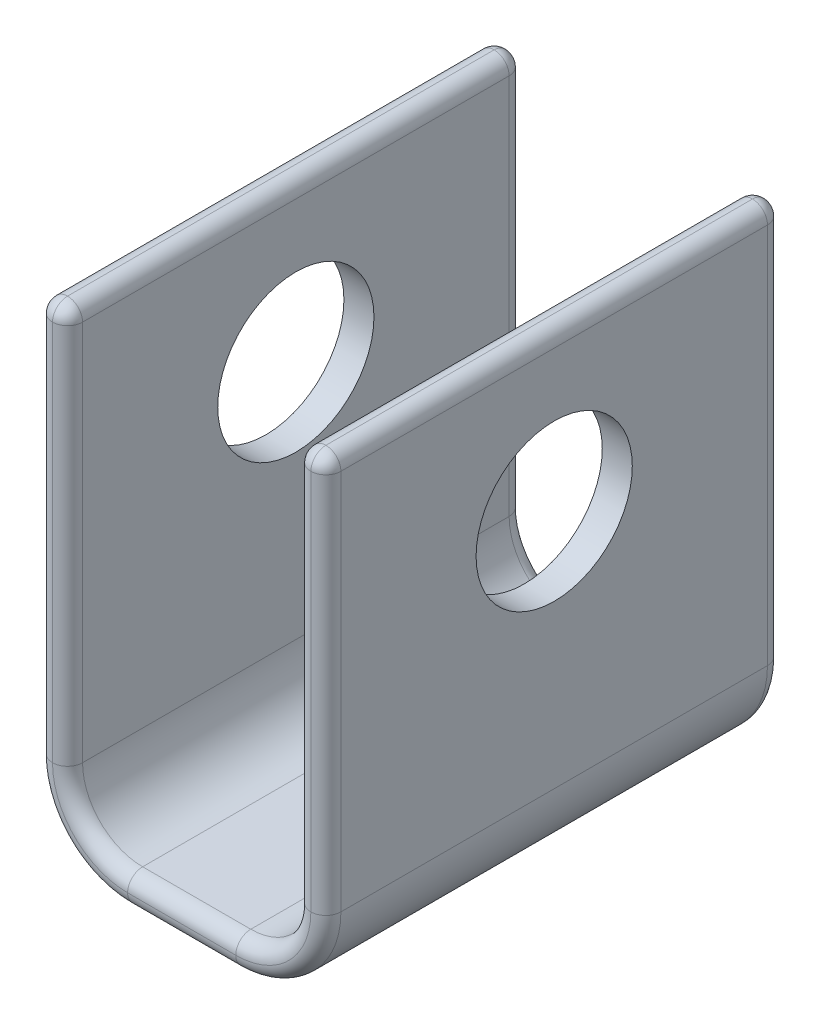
ISO-10303-21;
HEADER;
FILE_DESCRIPTION(('STEP AP214'),'2;1');
FILE_NAME('part.step','',(''),(''),'','','');
FILE_SCHEMA(('AUTOMOTIVE_DESIGN { 1 0 10303 214 1 1 1 1 }'));
ENDSEC;
DATA;
#1=APPLICATION_CONTEXT('core data for automotive mechanical design processes');
#2=APPLICATION_PROTOCOL_DEFINITION('international standard','automotive_design',2000,#1);
#3=PRODUCT_CONTEXT('',#1,'mechanical');
#4=PRODUCT('Part','Part','',(#3));
#5=PRODUCT_RELATED_PRODUCT_CATEGORY('part','',(#4));
#6=PRODUCT_DEFINITION_FORMATION('','',#4);
#7=PRODUCT_DEFINITION_CONTEXT('part definition',#1,'design');
#8=PRODUCT_DEFINITION('design','',#6,#7);
#9=PRODUCT_DEFINITION_SHAPE('','',#8);
#10=(LENGTH_UNIT() NAMED_UNIT(*) SI_UNIT(.MILLI.,.METRE.));
#11=(NAMED_UNIT(*) PLANE_ANGLE_UNIT() SI_UNIT($,.RADIAN.));
#12=(NAMED_UNIT(*) SI_UNIT($,.STERADIAN.) SOLID_ANGLE_UNIT());
#13=UNCERTAINTY_MEASURE_WITH_UNIT(LENGTH_MEASURE(1.E-05),#10,'distance_accuracy_value','');
#14=(GEOMETRIC_REPRESENTATION_CONTEXT(3) GLOBAL_UNCERTAINTY_ASSIGNED_CONTEXT((#13)) GLOBAL_UNIT_ASSIGNED_CONTEXT((#10,
#11,#12)) REPRESENTATION_CONTEXT('',''));
#15=CARTESIAN_POINT('',(0.,0.,0.));
#16=DIRECTION('',(0.,0.,1.));
#17=DIRECTION('',(1.,0.,0.));
#18=AXIS2_PLACEMENT_3D('',#15,#16,#17);
#19=CARTESIAN_POINT('',(12.,5.00000000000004,19.));
#20=DIRECTION('',(-1.,0.,0.));
#21=DIRECTION('',(0.,0.,1.));
#22=AXIS2_PLACEMENT_3D('',#19,#20,#21);
#23=PLANE('',#22);
#24=CARTESIAN_POINT('',(12.,25.003829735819,0.));
#25=DIRECTION('',(1.,0.,0.));
#26=DIRECTION('',(0.,0.,-1.));
#27=AXIS2_PLACEMENT_3D('',#24,#25,#26);
#28=CIRCLE('',#27,6.5);
#29=CARTESIAN_POINT('',(12.,25.003829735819,-6.5));
#30=VERTEX_POINT('',#29);
#31=EDGE_CURVE('E883',#30,#30,#28,.T.);
#32=ORIENTED_EDGE('',*,*,#31,.F.);
#33=EDGE_LOOP('',(#32));
#34=FACE_BOUND('',#33,.T.);
#35=DIRECTION('',(0.,0.,-1.));
#36=VECTOR('',#35,1.);
#37=CARTESIAN_POINT('',(12.,5.,19.));
#38=LINE('',#37,#36);
#39=CARTESIAN_POINT('',(12.,5.,17.75));
#40=VERTEX_POINT('',#39);
#41=CARTESIAN_POINT('',(12.,5.,-17.75));
#42=VERTEX_POINT('',#41);
#43=EDGE_CURVE('E270',#40,#42,#38,.T.);
#44=ORIENTED_EDGE('',*,*,#43,.T.);
#45=DIRECTION('',(0.,1.,0.));
#46=VECTOR('',#45,1.);
#47=CARTESIAN_POINT('',(12.,5.00000000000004,-17.75));
#48=LINE('',#47,#46);
#49=CARTESIAN_POINT('',(12.,36.753829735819,-17.75));
#50=VERTEX_POINT('',#49);
#51=EDGE_CURVE('E11',#42,#50,#48,.T.);
#52=ORIENTED_EDGE('',*,*,#51,.T.);
#53=DIRECTION('',(0.,0.,-1.));
#54=VECTOR('',#53,1.);
#55=CARTESIAN_POINT('',(12.,36.753829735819,19.));
#56=LINE('',#55,#54);
#57=CARTESIAN_POINT('',(12.,36.753829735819,17.75));
#58=VERTEX_POINT('',#57);
#59=EDGE_CURVE('E43',#50,#58,#56,.F.);
#60=ORIENTED_EDGE('',*,*,#59,.T.);
#61=DIRECTION('',(0.,1.,0.));
#62=VECTOR('',#61,1.);
#63=CARTESIAN_POINT('',(12.,5.,17.75));
#64=LINE('',#63,#62);
#65=EDGE_CURVE('E195',#58,#40,#64,.F.);
#66=ORIENTED_EDGE('',*,*,#65,.T.);
#67=EDGE_LOOP('',(#44,#52,#60,#66));
#68=FACE_BOUND('',#67,.T.);
#69=ADVANCED_FACE('F33',(#34,#68),#23,.F.);
#70=CARTESIAN_POINT('',(9.5,5.00000000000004,19.));
#71=DIRECTION('',(-1.,0.,0.));
#72=DIRECTION('',(0.,0.,1.));
#73=AXIS2_PLACEMENT_3D('',#70,#71,#72);
#74=PLANE('',#73);
#75=CARTESIAN_POINT('',(9.5,25.003829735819,0.));
#76=DIRECTION('',(-1.,0.,0.));
#77=DIRECTION('',(0.,0.,1.));
#78=AXIS2_PLACEMENT_3D('',#75,#76,#77);
#79=CIRCLE('',#78,6.5);
#80=CARTESIAN_POINT('',(9.5,25.003829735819,6.5));
#81=VERTEX_POINT('',#80);
#82=EDGE_CURVE('E282',#81,#81,#79,.T.);
#83=ORIENTED_EDGE('',*,*,#82,.F.);
#84=EDGE_LOOP('',(#83));
#85=FACE_BOUND('',#84,.T.);
#86=DIRECTION('',(0.,0.,-1.));
#87=VECTOR('',#86,1.);
#88=CARTESIAN_POINT('',(9.5,36.753829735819,19.));
#89=LINE('',#88,#87);
#90=CARTESIAN_POINT('',(9.5,36.753829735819,17.75));
#91=VERTEX_POINT('',#90);
#92=CARTESIAN_POINT('',(9.5,36.753829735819,-17.75));
#93=VERTEX_POINT('',#92);
#94=EDGE_CURVE('E299',#91,#93,#89,.T.);
#95=ORIENTED_EDGE('',*,*,#94,.T.);
#96=DIRECTION('',(0.,1.,0.));
#97=VECTOR('',#96,1.);
#98=CARTESIAN_POINT('',(9.5,5.,-17.75));
#99=LINE('',#98,#97);
#100=CARTESIAN_POINT('',(9.5,5.,-17.75));
#101=VERTEX_POINT('',#100);
#102=EDGE_CURVE('E303',#93,#101,#99,.F.);
#103=ORIENTED_EDGE('',*,*,#102,.T.);
#104=DIRECTION('',(0.,0.,-1.));
#105=VECTOR('',#104,1.);
#106=CARTESIAN_POINT('',(9.5,5.,19.));
#107=LINE('',#106,#105);
#108=CARTESIAN_POINT('',(9.5,5.,17.75));
#109=VERTEX_POINT('',#108);
#110=EDGE_CURVE('E297',#109,#101,#107,.T.);
#111=ORIENTED_EDGE('',*,*,#110,.F.);
#112=DIRECTION('',(0.,1.,0.));
#113=VECTOR('',#112,1.);
#114=CARTESIAN_POINT('',(9.5,5.00000000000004,17.75));
#115=LINE('',#114,#113);
#116=EDGE_CURVE('E301',#109,#91,#115,.T.);
#117=ORIENTED_EDGE('',*,*,#116,.T.);
#118=EDGE_LOOP('',(#95,#103,#111,#117));
#119=FACE_BOUND('',#118,.T.);
#120=ADVANCED_FACE('F483',(#85,#119),#74,.T.);
#121=CARTESIAN_POINT('',(4.5,5.,19.));
#122=DIRECTION('',(0.,0.,-1.));
#123=DIRECTION('',(-1.,0.,0.));
#124=AXIS2_PLACEMENT_3D('',#121,#122,#123);
#125=CYLINDRICAL_SURFACE('',#124,5.);
#126=ORIENTED_EDGE('',*,*,#110,.T.);
#127=CARTESIAN_POINT('',(4.5,5.,-17.75));
#128=DIRECTION('',(0.,0.,1.));
#129=DIRECTION('',(1.,0.,0.));
#130=AXIS2_PLACEMENT_3D('',#127,#128,#129);
#131=CIRCLE('',#130,5.);
#132=CARTESIAN_POINT('',(4.49999999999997,0.,-17.75));
#133=VERTEX_POINT('',#132);
#134=EDGE_CURVE('E307',#101,#133,#131,.F.);
#135=ORIENTED_EDGE('',*,*,#134,.T.);
#136=DIRECTION('',(0.,0.,-1.));
#137=VECTOR('',#136,1.);
#138=CARTESIAN_POINT('',(4.49999999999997,0.,19.));
#139=LINE('',#138,#137);
#140=CARTESIAN_POINT('',(4.49999999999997,0.,17.75));
#141=VERTEX_POINT('',#140);
#142=EDGE_CURVE('E294',#141,#133,#139,.T.);
#143=ORIENTED_EDGE('',*,*,#142,.F.);
#144=CARTESIAN_POINT('',(4.5,5.,17.75));
#145=DIRECTION('',(0.,0.,1.));
#146=DIRECTION('',(1.,0.,0.));
#147=AXIS2_PLACEMENT_3D('',#144,#145,#146);
#148=CIRCLE('',#147,5.);
#149=EDGE_CURVE('E119',#141,#109,#148,.T.);
#150=ORIENTED_EDGE('',*,*,#149,.T.);
#151=EDGE_LOOP('',(#126,#135,#143,#150));
#152=FACE_BOUND('',#151,.T.);
#153=ADVANCED_FACE('F489',(#152),#125,.F.);
#154=CARTESIAN_POINT('',(-4.49999999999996,0.,19.));
#155=DIRECTION('',(0.,1.,0.));
#156=DIRECTION('',(0.,0.,1.));
#157=AXIS2_PLACEMENT_3D('',#154,#155,#156);
#158=PLANE('',#157);
#159=ORIENTED_EDGE('',*,*,#142,.T.);
#160=DIRECTION('',(1.,0.,0.));
#161=VECTOR('',#160,1.);
#162=CARTESIAN_POINT('',(-4.49999999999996,0.,-17.75));
#163=LINE('',#162,#161);
#164=CARTESIAN_POINT('',(-4.49999999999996,0.,-17.75));
#165=VERTEX_POINT('',#164);
#166=EDGE_CURVE('E311',#133,#165,#163,.F.);
#167=ORIENTED_EDGE('',*,*,#166,.T.);
#168=DIRECTION('',(0.,0.,-1.));
#169=VECTOR('',#168,1.);
#170=CARTESIAN_POINT('',(-4.49999999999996,0.,19.));
#171=LINE('',#170,#169);
#172=CARTESIAN_POINT('',(-4.49999999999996,0.,17.75));
#173=VERTEX_POINT('',#172);
#174=EDGE_CURVE('E291',#173,#165,#171,.T.);
#175=ORIENTED_EDGE('',*,*,#174,.F.);
#176=DIRECTION('',(1.,0.,0.));
#177=VECTOR('',#176,1.);
#178=CARTESIAN_POINT('',(-4.49999999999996,0.,17.75));
#179=LINE('',#178,#177);
#180=EDGE_CURVE('E309',#173,#141,#179,.T.);
#181=ORIENTED_EDGE('',*,*,#180,.T.);
#182=EDGE_LOOP('',(#159,#167,#175,#181));
#183=FACE_BOUND('',#182,.T.);
#184=ADVANCED_FACE('F814',(#183),#158,.T.);
#185=CARTESIAN_POINT('',(-4.5,5.,19.));
#186=DIRECTION('',(0.,0.,-1.));
#187=DIRECTION('',(-1.,0.,0.));
#188=AXIS2_PLACEMENT_3D('',#185,#186,#187);
#189=CYLINDRICAL_SURFACE('',#188,5.);
#190=ORIENTED_EDGE('',*,*,#174,.T.);
#191=CARTESIAN_POINT('',(-4.5,5.,-17.75));
#192=DIRECTION('',(0.,0.,1.));
#193=DIRECTION('',(1.,0.,0.));
#194=AXIS2_PLACEMENT_3D('',#191,#192,#193);
#195=CIRCLE('',#194,5.);
#196=CARTESIAN_POINT('',(-9.5,5.00000000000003,-17.75));
#197=VERTEX_POINT('',#196);
#198=EDGE_CURVE('E315',#165,#197,#195,.F.);
#199=ORIENTED_EDGE('',*,*,#198,.T.);
#200=DIRECTION('',(0.,0.,-1.));
#201=VECTOR('',#200,1.);
#202=CARTESIAN_POINT('',(-9.5,5.00000000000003,19.));
#203=LINE('',#202,#201);
#204=CARTESIAN_POINT('',(-9.5,5.00000000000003,17.75));
#205=VERTEX_POINT('',#204);
#206=EDGE_CURVE('E190',#205,#197,#203,.T.);
#207=ORIENTED_EDGE('',*,*,#206,.F.);
#208=CARTESIAN_POINT('',(-4.5,5.,17.75));
#209=DIRECTION('',(0.,0.,1.));
#210=DIRECTION('',(1.,0.,0.));
#211=AXIS2_PLACEMENT_3D('',#208,#209,#210);
#212=CIRCLE('',#211,5.);
#213=EDGE_CURVE('E313',#205,#173,#212,.T.);
#214=ORIENTED_EDGE('',*,*,#213,.T.);
#215=EDGE_LOOP('',(#190,#199,#207,#214));
#216=FACE_BOUND('',#215,.T.);
#217=ADVANCED_FACE('F805',(#216),#189,.F.);
#218=CARTESIAN_POINT('',(-9.5,38.003829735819,19.));
#219=DIRECTION('',(1.,0.,0.));
#220=DIRECTION('',(0.,1.,0.));
#221=AXIS2_PLACEMENT_3D('',#218,#219,#220);
#222=PLANE('',#221);
#223=CARTESIAN_POINT('',(-9.5,25.003829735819,0.));
#224=DIRECTION('',(1.,0.,0.));
#225=DIRECTION('',(0.,1.,0.));
#226=AXIS2_PLACEMENT_3D('',#223,#224,#225);
#227=CIRCLE('',#226,6.5);
#228=CARTESIAN_POINT('',(-9.5,31.503829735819,0.));
#229=VERTEX_POINT('',#228);
#230=EDGE_CURVE('E879',#229,#229,#227,.T.);
#231=ORIENTED_EDGE('',*,*,#230,.F.);
#232=EDGE_LOOP('',(#231));
#233=FACE_BOUND('',#232,.T.);
#234=ORIENTED_EDGE('',*,*,#206,.T.);
#235=DIRECTION('',(0.,-1.,0.));
#236=VECTOR('',#235,1.);
#237=CARTESIAN_POINT('',(-9.5,38.003829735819,-17.75));
#238=LINE('',#237,#236);
#239=CARTESIAN_POINT('',(-9.5,36.753829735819,-17.75));
#240=VERTEX_POINT('',#239);
#241=EDGE_CURVE('E184',#197,#240,#238,.F.);
#242=ORIENTED_EDGE('',*,*,#241,.T.);
#243=DIRECTION('',(0.,0.,-1.));
#244=VECTOR('',#243,1.);
#245=CARTESIAN_POINT('',(-9.5,36.753829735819,19.));
#246=LINE('',#245,#244);
#247=CARTESIAN_POINT('',(-9.5,36.753829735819,17.75));
#248=VERTEX_POINT('',#247);
#249=EDGE_CURVE('E187',#240,#248,#246,.F.);
#250=ORIENTED_EDGE('',*,*,#249,.T.);
#251=DIRECTION('',(0.,-1.,0.));
#252=VECTOR('',#251,1.);
#253=CARTESIAN_POINT('',(-9.5,38.003829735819,17.75));
#254=LINE('',#253,#252);
#255=EDGE_CURVE('E206',#248,#205,#254,.T.);
#256=ORIENTED_EDGE('',*,*,#255,.T.);
#257=EDGE_LOOP('',(#234,#242,#250,#256));
#258=FACE_BOUND('',#257,.T.);
#259=ADVANCED_FACE('F186',(#233,#258),#222,.T.);
#260=CARTESIAN_POINT('',(-12.,38.003829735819,19.));
#261=DIRECTION('',(1.,0.,0.));
#262=DIRECTION('',(0.,1.,0.));
#263=AXIS2_PLACEMENT_3D('',#260,#261,#262);
#264=PLANE('',#263);
#265=CARTESIAN_POINT('',(-12.,25.003829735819,0.));
#266=DIRECTION('',(1.,0.,0.));
#267=DIRECTION('',(0.,0.,-1.));
#268=AXIS2_PLACEMENT_3D('',#265,#266,#267);
#269=CIRCLE('',#268,6.5);
#270=CARTESIAN_POINT('',(-12.,25.003829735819,-6.5));
#271=VERTEX_POINT('',#270);
#272=EDGE_CURVE('E880',#271,#271,#269,.T.);
#273=ORIENTED_EDGE('',*,*,#272,.T.);
#274=EDGE_LOOP('',(#273));
#275=FACE_BOUND('',#274,.T.);
#276=DIRECTION('',(0.,0.,-1.));
#277=VECTOR('',#276,1.);
#278=CARTESIAN_POINT('',(-12.,36.753829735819,-19.));
#279=LINE('',#278,#277);
#280=CARTESIAN_POINT('',(-12.,36.753829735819,17.75));
#281=VERTEX_POINT('',#280);
#282=CARTESIAN_POINT('',(-12.,36.753829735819,-17.75));
#283=VERTEX_POINT('',#282);
#284=EDGE_CURVE('E317',#281,#283,#279,.T.);
#285=ORIENTED_EDGE('',*,*,#284,.T.);
#286=DIRECTION('',(0.,-1.,0.));
#287=VECTOR('',#286,1.);
#288=CARTESIAN_POINT('',(-12.,38.003829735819,-17.75));
#289=LINE('',#288,#287);
#290=CARTESIAN_POINT('',(-12.,5.00000000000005,-17.75));
#291=VERTEX_POINT('',#290);
#292=EDGE_CURVE('E321',#283,#291,#289,.T.);
#293=ORIENTED_EDGE('',*,*,#292,.T.);
#294=DIRECTION('',(0.,0.,-1.));
#295=VECTOR('',#294,1.);
#296=CARTESIAN_POINT('',(-12.,5.00000000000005,19.));
#297=LINE('',#296,#295);
#298=CARTESIAN_POINT('',(-12.,5.00000000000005,17.75));
#299=VERTEX_POINT('',#298);
#300=EDGE_CURVE('E287',#299,#291,#297,.T.);
#301=ORIENTED_EDGE('',*,*,#300,.F.);
#302=DIRECTION('',(0.,-1.,0.));
#303=VECTOR('',#302,1.);
#304=CARTESIAN_POINT('',(-12.,38.003829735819,17.75));
#305=LINE('',#304,#303);
#306=EDGE_CURVE('E319',#299,#281,#305,.F.);
#307=ORIENTED_EDGE('',*,*,#306,.T.);
#308=EDGE_LOOP('',(#285,#293,#301,#307));
#309=FACE_BOUND('',#308,.T.);
#310=ADVANCED_FACE('F462',(#275,#309),#264,.F.);
#311=CARTESIAN_POINT('',(-4.5,5.,19.));
#312=DIRECTION('',(0.,0.,-1.));
#313=DIRECTION('',(-1.,0.,0.));
#314=AXIS2_PLACEMENT_3D('',#311,#312,#313);
#315=CYLINDRICAL_SURFACE('',#314,7.5);
#316=ORIENTED_EDGE('',*,*,#300,.T.);
#317=CARTESIAN_POINT('',(-4.5,5.,-17.75));
#318=DIRECTION('',(0.,0.,1.));
#319=DIRECTION('',(1.,0.,0.));
#320=AXIS2_PLACEMENT_3D('',#317,#318,#319);
#321=CIRCLE('',#320,7.5);
#322=CARTESIAN_POINT('',(-4.49999999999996,-2.5,-17.75));
#323=VERTEX_POINT('',#322);
#324=EDGE_CURVE('E326',#291,#323,#321,.T.);
#325=ORIENTED_EDGE('',*,*,#324,.T.);
#326=DIRECTION('',(0.,0.,-1.));
#327=VECTOR('',#326,1.);
#328=CARTESIAN_POINT('',(-4.49999999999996,-2.5,19.));
#329=LINE('',#328,#327);
#330=CARTESIAN_POINT('',(-4.49999999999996,-2.5,17.75));
#331=VERTEX_POINT('',#330);
#332=EDGE_CURVE('E279',#331,#323,#329,.T.);
#333=ORIENTED_EDGE('',*,*,#332,.F.);
#334=CARTESIAN_POINT('',(-4.5,5.,17.75));
#335=DIRECTION('',(0.,0.,1.));
#336=DIRECTION('',(1.,0.,0.));
#337=AXIS2_PLACEMENT_3D('',#334,#335,#336);
#338=CIRCLE('',#337,7.5);
#339=EDGE_CURVE('E324',#331,#299,#338,.F.);
#340=ORIENTED_EDGE('',*,*,#339,.T.);
#341=EDGE_LOOP('',(#316,#325,#333,#340));
#342=FACE_BOUND('',#341,.T.);
#343=ADVANCED_FACE('F460',(#342),#315,.T.);
#344=CARTESIAN_POINT('',(-4.49999999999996,-2.5,19.));
#345=DIRECTION('',(0.,1.,0.));
#346=DIRECTION('',(0.,0.,1.));
#347=AXIS2_PLACEMENT_3D('',#344,#345,#346);
#348=PLANE('',#347);
#349=ORIENTED_EDGE('',*,*,#332,.T.);
#350=DIRECTION('',(1.,0.,0.));
#351=VECTOR('',#350,1.);
#352=CARTESIAN_POINT('',(-4.49999999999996,-2.5,-17.75));
#353=LINE('',#352,#351);
#354=CARTESIAN_POINT('',(4.49999999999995,-2.5,-17.75));
#355=VERTEX_POINT('',#354);
#356=EDGE_CURVE('E330',#323,#355,#353,.T.);
#357=ORIENTED_EDGE('',*,*,#356,.T.);
#358=DIRECTION('',(0.,0.,-1.));
#359=VECTOR('',#358,1.);
#360=CARTESIAN_POINT('',(4.49999999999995,-2.5,19.));
#361=LINE('',#360,#359);
#362=CARTESIAN_POINT('',(4.49999999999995,-2.5,17.75));
#363=VERTEX_POINT('',#362);
#364=EDGE_CURVE('E274',#363,#355,#361,.T.);
#365=ORIENTED_EDGE('',*,*,#364,.F.);
#366=DIRECTION('',(1.,0.,0.));
#367=VECTOR('',#366,1.);
#368=CARTESIAN_POINT('',(-4.49999999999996,-2.5,17.75));
#369=LINE('',#368,#367);
#370=EDGE_CURVE('E328',#363,#331,#369,.F.);
#371=ORIENTED_EDGE('',*,*,#370,.T.);
#372=EDGE_LOOP('',(#349,#357,#365,#371));
#373=FACE_BOUND('',#372,.T.);
#374=ADVANCED_FACE('F436',(#373),#348,.F.);
#375=CARTESIAN_POINT('',(4.5,5.,19.));
#376=DIRECTION('',(0.,0.,-1.));
#377=DIRECTION('',(-1.,0.,0.));
#378=AXIS2_PLACEMENT_3D('',#375,#376,#377);
#379=CYLINDRICAL_SURFACE('',#378,7.5);
#380=ORIENTED_EDGE('',*,*,#364,.T.);
#381=CARTESIAN_POINT('',(4.5,5.,-17.75));
#382=DIRECTION('',(0.,0.,1.));
#383=DIRECTION('',(1.,0.,0.));
#384=AXIS2_PLACEMENT_3D('',#381,#382,#383);
#385=CIRCLE('',#384,7.5);
#386=EDGE_CURVE('E334',#355,#42,#385,.T.);
#387=ORIENTED_EDGE('',*,*,#386,.T.);
#388=ORIENTED_EDGE('',*,*,#43,.F.);
#389=CARTESIAN_POINT('',(4.5,5.,17.75));
#390=DIRECTION('',(0.,0.,1.));
#391=DIRECTION('',(1.,0.,0.));
#392=AXIS2_PLACEMENT_3D('',#389,#390,#391);
#393=CIRCLE('',#392,7.5);
#394=EDGE_CURVE('E332',#40,#363,#393,.F.);
#395=ORIENTED_EDGE('',*,*,#394,.T.);
#396=EDGE_LOOP('',(#380,#387,#388,#395));
#397=FACE_BOUND('',#396,.T.);
#398=ADVANCED_FACE('F431',(#397),#379,.T.);
#399=CARTESIAN_POINT('',(-10.75,5.,17.75));
#400=DIRECTION('',(0.,1.,0.));
#401=DIRECTION('',(-1.,0.,0.));
#402=AXIS2_PLACEMENT_3D('',#399,#400,#401);
#403=CYLINDRICAL_SURFACE('',#402,1.25);
#404=DIRECTION('',(0.,-1.,0.));
#405=VECTOR('',#404,1.);
#406=CARTESIAN_POINT('',(-10.75,5.00000000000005,19.));
#407=LINE('',#406,#405);
#408=CARTESIAN_POINT('',(-10.75,36.753829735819,19.));
#409=VERTEX_POINT('',#408);
#410=CARTESIAN_POINT('',(-10.75,5.00000000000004,19.));
#411=VERTEX_POINT('',#410);
#412=EDGE_CURVE('E265',#409,#411,#407,.T.);
#413=ORIENTED_EDGE('',*,*,#412,.F.);
#414=CARTESIAN_POINT('',(-10.75,36.753829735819,17.75));
#415=DIRECTION('',(0.,1.,0.));
#416=DIRECTION('',(0.,0.,1.));
#417=AXIS2_PLACEMENT_3D('',#414,#415,#416);
#418=CIRCLE('',#417,1.25);
#419=EDGE_CURVE('E37',#281,#409,#418,.T.);
#420=ORIENTED_EDGE('',*,*,#419,.F.);
#421=ORIENTED_EDGE('',*,*,#306,.F.);
#422=CARTESIAN_POINT('',(-10.75,5.00000000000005,17.75));
#423=DIRECTION('',(0.,-1.,0.));
#424=DIRECTION('',(0.,0.,-1.));
#425=AXIS2_PLACEMENT_3D('',#422,#423,#424);
#426=CIRCLE('',#425,1.25);
#427=EDGE_CURVE('E103',#411,#299,#426,.T.);
#428=ORIENTED_EDGE('',*,*,#427,.F.);
#429=EDGE_LOOP('',(#413,#420,#421,#428));
#430=FACE_BOUND('',#429,.T.);
#431=ADVANCED_FACE('F35',(#430),#403,.T.);
#432=CARTESIAN_POINT('',(-10.75,36.753829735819,17.75));
#433=DIRECTION('',(0.,0.,1.));
#434=DIRECTION('',(1.,0.,0.));
#435=AXIS2_PLACEMENT_3D('',#432,#433,#434);
#436=SPHERICAL_SURFACE('',#435,1.25);
#437=ORIENTED_EDGE('',*,*,#419,.T.);
#438=CARTESIAN_POINT('',(-10.75,36.753829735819,17.75));
#439=DIRECTION('',(1.,0.,0.));
#440=DIRECTION('',(0.,0.,-1.));
#441=AXIS2_PLACEMENT_3D('',#438,#439,#440);
#442=CIRCLE('',#441,1.25);
#443=CARTESIAN_POINT('',(-10.75,38.003829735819,17.75));
#444=VERTEX_POINT('',#443);
#445=EDGE_CURVE('E110',#444,#409,#442,.T.);
#446=ORIENTED_EDGE('',*,*,#445,.F.);
#447=CARTESIAN_POINT('',(-10.75,36.753829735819,17.75));
#448=DIRECTION('',(0.,0.,1.));
#449=DIRECTION('',(1.,0.,0.));
#450=AXIS2_PLACEMENT_3D('',#447,#448,#449);
#451=CIRCLE('',#450,1.25);
#452=EDGE_CURVE('E259',#281,#444,#451,.F.);
#453=ORIENTED_EDGE('',*,*,#452,.F.);
#454=EDGE_LOOP('',(#437,#446,#453));
#455=FACE_BOUND('',#454,.T.);
#456=ADVANCED_FACE('F464',(#455),#436,.T.);
#457=CARTESIAN_POINT('',(-4.5,5.,17.75));
#458=DIRECTION('',(0.,0.,1.));
#459=DIRECTION('',(1.,0.,0.));
#460=AXIS2_PLACEMENT_3D('',#457,#458,#459);
#461=TOROIDAL_SURFACE('',#460,6.25,1.25);
#462=ORIENTED_EDGE('',*,*,#427,.T.);
#463=ORIENTED_EDGE('',*,*,#339,.F.);
#464=CARTESIAN_POINT('',(-4.49999999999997,-1.25,17.75));
#465=DIRECTION('',(1.,0.,0.));
#466=DIRECTION('',(0.,1.,0.));
#467=AXIS2_PLACEMENT_3D('',#464,#465,#466);
#468=CIRCLE('',#467,1.25);
#469=CARTESIAN_POINT('',(-4.49999999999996,-1.25,19.));
#470=VERTEX_POINT('',#469);
#471=EDGE_CURVE('E256',#470,#331,#468,.T.);
#472=ORIENTED_EDGE('',*,*,#471,.F.);
#473=CARTESIAN_POINT('',(-4.5,5.,19.));
#474=DIRECTION('',(0.,0.,1.));
#475=DIRECTION('',(1.,0.,0.));
#476=AXIS2_PLACEMENT_3D('',#473,#474,#475);
#477=CIRCLE('',#476,6.25);
#478=EDGE_CURVE('E253',#411,#470,#477,.T.);
#479=ORIENTED_EDGE('',*,*,#478,.F.);
#480=EDGE_LOOP('',(#462,#463,#472,#479));
#481=FACE_BOUND('',#480,.T.);
#482=ADVANCED_FACE('F457',(#481),#461,.T.);
#483=CARTESIAN_POINT('',(-10.75,38.003829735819,17.75));
#484=DIRECTION('',(0.,-1.,0.));
#485=DIRECTION('',(1.,0.,0.));
#486=AXIS2_PLACEMENT_3D('',#483,#484,#485);
#487=CYLINDRICAL_SURFACE('',#486,1.25);
#488=CARTESIAN_POINT('',(-10.75,36.753829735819,17.75));
#489=DIRECTION('',(0.,1.,0.));
#490=DIRECTION('',(0.,0.,1.));
#491=AXIS2_PLACEMENT_3D('',#488,#489,#490);
#492=CIRCLE('',#491,1.25);
#493=EDGE_CURVE('E263',#409,#248,#492,.T.);
#494=ORIENTED_EDGE('',*,*,#493,.F.);
#495=ORIENTED_EDGE('',*,*,#412,.T.);
#496=CARTESIAN_POINT('',(-10.75,5.00000000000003,17.75));
#497=DIRECTION('',(0.,-1.,0.));
#498=DIRECTION('',(0.,0.,-1.));
#499=AXIS2_PLACEMENT_3D('',#496,#497,#498);
#500=CIRCLE('',#499,1.25);
#501=EDGE_CURVE('E250',#205,#411,#500,.T.);
#502=ORIENTED_EDGE('',*,*,#501,.F.);
#503=ORIENTED_EDGE('',*,*,#255,.F.);
#504=EDGE_LOOP('',(#494,#495,#502,#503));
#505=FACE_BOUND('',#504,.T.);
#506=ADVANCED_FACE('F741',(#505),#487,.T.);
#507=CARTESIAN_POINT('',(-10.75,36.753829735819,17.75));
#508=DIRECTION('',(0.,0.,1.));
#509=DIRECTION('',(1.,0.,0.));
#510=AXIS2_PLACEMENT_3D('',#507,#508,#509);
#511=SPHERICAL_SURFACE('',#510,1.25);
#512=ORIENTED_EDGE('',*,*,#445,.T.);
#513=ORIENTED_EDGE('',*,*,#493,.T.);
#514=CARTESIAN_POINT('',(-10.75,36.753829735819,17.75));
#515=DIRECTION('',(0.,0.,1.));
#516=DIRECTION('',(1.,0.,0.));
#517=AXIS2_PLACEMENT_3D('',#514,#515,#516);
#518=CIRCLE('',#517,1.25);
#519=EDGE_CURVE('E205',#444,#248,#518,.F.);
#520=ORIENTED_EDGE('',*,*,#519,.F.);
#521=EDGE_LOOP('',(#512,#513,#520));
#522=FACE_BOUND('',#521,.T.);
#523=ADVANCED_FACE('F733',(#522),#511,.T.);
#524=CARTESIAN_POINT('',(-10.75,36.753829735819,19.));
#525=DIRECTION('',(0.,0.,1.));
#526=DIRECTION('',(1.,0.,0.));
#527=AXIS2_PLACEMENT_3D('',#524,#525,#526);
#528=CYLINDRICAL_SURFACE('',#527,1.25);
#529=ORIENTED_EDGE('',*,*,#284,.F.);
#530=ORIENTED_EDGE('',*,*,#452,.T.);
#531=DIRECTION('',(0.,0.,-1.));
#532=VECTOR('',#531,1.);
#533=CARTESIAN_POINT('',(-10.75,38.003829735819,19.));
#534=LINE('',#533,#532);
#535=CARTESIAN_POINT('',(-10.75,38.003829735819,-17.75));
#536=VERTEX_POINT('',#535);
#537=EDGE_CURVE('E247',#536,#444,#534,.F.);
#538=ORIENTED_EDGE('',*,*,#537,.F.);
#539=CARTESIAN_POINT('',(-10.75,36.753829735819,-17.75));
#540=DIRECTION('',(0.,0.,-1.));
#541=DIRECTION('',(-1.,0.,0.));
#542=AXIS2_PLACEMENT_3D('',#539,#540,#541);
#543=CIRCLE('',#542,1.25);
#544=EDGE_CURVE('E245',#283,#536,#543,.T.);
#545=ORIENTED_EDGE('',*,*,#544,.F.);
#546=EDGE_LOOP('',(#529,#530,#538,#545));
#547=FACE_BOUND('',#546,.T.);
#548=ADVANCED_FACE('F467',(#547),#528,.T.);
#549=CARTESIAN_POINT('',(4.5,-1.25,17.75));
#550=DIRECTION('',(-1.,0.,0.));
#551=DIRECTION('',(0.,0.,1.));
#552=AXIS2_PLACEMENT_3D('',#549,#550,#551);
#553=CYLINDRICAL_SURFACE('',#552,1.25);
#554=ORIENTED_EDGE('',*,*,#471,.T.);
#555=ORIENTED_EDGE('',*,*,#370,.F.);
#556=CARTESIAN_POINT('',(4.49999999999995,-1.25,17.75));
#557=DIRECTION('',(1.,0.,0.));
#558=DIRECTION('',(0.,0.,-1.));
#559=AXIS2_PLACEMENT_3D('',#556,#557,#558);
#560=CIRCLE('',#559,1.25);
#561=CARTESIAN_POINT('',(4.49999999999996,-1.25,19.));
#562=VERTEX_POINT('',#561);
#563=EDGE_CURVE('E242',#562,#363,#560,.T.);
#564=ORIENTED_EDGE('',*,*,#563,.F.);
#565=DIRECTION('',(1.,0.,0.));
#566=VECTOR('',#565,1.);
#567=CARTESIAN_POINT('',(4.49999999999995,-1.25,19.));
#568=LINE('',#567,#566);
#569=EDGE_CURVE('E239',#470,#562,#568,.T.);
#570=ORIENTED_EDGE('',*,*,#569,.F.);
#571=EDGE_LOOP('',(#554,#555,#564,#570));
#572=FACE_BOUND('',#571,.T.);
#573=ADVANCED_FACE('F439',(#572),#553,.T.);
#574=CARTESIAN_POINT('',(-4.5,5.,17.75));
#575=DIRECTION('',(0.,0.,1.));
#576=DIRECTION('',(1.,0.,0.));
#577=AXIS2_PLACEMENT_3D('',#574,#575,#576);
#578=TOROIDAL_SURFACE('',#577,6.25,1.25);
#579=ORIENTED_EDGE('',*,*,#501,.T.);
#580=ORIENTED_EDGE('',*,*,#478,.T.);
#581=CARTESIAN_POINT('',(-4.49999999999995,-1.25,17.75));
#582=DIRECTION('',(1.,0.,0.));
#583=DIRECTION('',(0.,1.,0.));
#584=AXIS2_PLACEMENT_3D('',#581,#582,#583);
#585=CIRCLE('',#584,1.25);
#586=EDGE_CURVE('E215',#173,#470,#585,.T.);
#587=ORIENTED_EDGE('',*,*,#586,.F.);
#588=ORIENTED_EDGE('',*,*,#213,.F.);
#589=EDGE_LOOP('',(#579,#580,#587,#588));
#590=FACE_BOUND('',#589,.T.);
#591=ADVANCED_FACE('F455',(#590),#578,.T.);
#592=CARTESIAN_POINT('',(-10.75,36.753829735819,19.));
#593=DIRECTION('',(0.,0.,-1.));
#594=DIRECTION('',(-1.,0.,0.));
#595=AXIS2_PLACEMENT_3D('',#592,#593,#594);
#596=CYLINDRICAL_SURFACE('',#595,1.25);
#597=CARTESIAN_POINT('',(-10.75,36.753829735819,-17.75));
#598=DIRECTION('',(0.,0.,-1.));
#599=DIRECTION('',(-1.,0.,0.));
#600=AXIS2_PLACEMENT_3D('',#597,#598,#599);
#601=CIRCLE('',#600,1.25);
#602=EDGE_CURVE('E203',#536,#240,#601,.T.);
#603=ORIENTED_EDGE('',*,*,#602,.F.);
#604=ORIENTED_EDGE('',*,*,#537,.T.);
#605=ORIENTED_EDGE('',*,*,#519,.T.);
#606=ORIENTED_EDGE('',*,*,#249,.F.);
#607=EDGE_LOOP('',(#603,#604,#605,#606));
#608=FACE_BOUND('',#607,.T.);
#609=ADVANCED_FACE('F201',(#608),#596,.T.);
#610=CARTESIAN_POINT('',(-10.75,36.753829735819,-17.75));
#611=DIRECTION('',(0.,0.,1.));
#612=DIRECTION('',(1.,0.,0.));
#613=AXIS2_PLACEMENT_3D('',#610,#611,#612);
#614=SPHERICAL_SURFACE('',#613,1.25);
#615=ORIENTED_EDGE('',*,*,#544,.T.);
#616=CARTESIAN_POINT('',(-10.75,36.753829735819,-17.75));
#617=DIRECTION('',(1.,0.,0.));
#618=DIRECTION('',(0.,0.,-1.));
#619=AXIS2_PLACEMENT_3D('',#616,#617,#618);
#620=CIRCLE('',#619,1.25);
#621=CARTESIAN_POINT('',(-10.75,36.753829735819,-19.));
#622=VERTEX_POINT('',#621);
#623=EDGE_CURVE('E214',#622,#536,#620,.T.);
#624=ORIENTED_EDGE('',*,*,#623,.F.);
#625=CARTESIAN_POINT('',(-10.75,36.753829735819,-17.75));
#626=DIRECTION('',(0.,1.,0.));
#627=DIRECTION('',(0.,0.,1.));
#628=AXIS2_PLACEMENT_3D('',#625,#626,#627);
#629=CIRCLE('',#628,1.25);
#630=EDGE_CURVE('E233',#283,#622,#629,.F.);
#631=ORIENTED_EDGE('',*,*,#630,.F.);
#632=EDGE_LOOP('',(#615,#624,#631));
#633=FACE_BOUND('',#632,.T.);
#634=ADVANCED_FACE('F470',(#633),#614,.T.);
#635=CARTESIAN_POINT('',(4.5,5.,17.75));
#636=DIRECTION('',(0.,0.,1.));
#637=DIRECTION('',(1.,0.,0.));
#638=AXIS2_PLACEMENT_3D('',#635,#636,#637);
#639=TOROIDAL_SURFACE('',#638,6.25,1.25);
#640=ORIENTED_EDGE('',*,*,#563,.T.);
#641=ORIENTED_EDGE('',*,*,#394,.F.);
#642=CARTESIAN_POINT('',(10.75,5.,17.75));
#643=DIRECTION('',(0.,1.,0.));
#644=DIRECTION('',(0.,0.,1.));
#645=AXIS2_PLACEMENT_3D('',#642,#643,#644);
#646=CIRCLE('',#645,1.25);
#647=CARTESIAN_POINT('',(10.75,5.,19.));
#648=VERTEX_POINT('',#647);
#649=EDGE_CURVE('E230',#648,#40,#646,.T.);
#650=ORIENTED_EDGE('',*,*,#649,.F.);
#651=CARTESIAN_POINT('',(4.5,5.,19.));
#652=DIRECTION('',(0.,0.,1.));
#653=DIRECTION('',(1.,0.,0.));
#654=AXIS2_PLACEMENT_3D('',#651,#652,#653);
#655=CIRCLE('',#654,6.25);
#656=EDGE_CURVE('E222',#562,#648,#655,.T.);
#657=ORIENTED_EDGE('',*,*,#656,.F.);
#658=EDGE_LOOP('',(#640,#641,#650,#657));
#659=FACE_BOUND('',#658,.T.);
#660=ADVANCED_FACE('F443',(#659),#639,.T.);
#661=CARTESIAN_POINT('',(-4.49999999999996,-1.25,17.75));
#662=DIRECTION('',(1.,0.,0.));
#663=DIRECTION('',(0.,0.,-1.));
#664=AXIS2_PLACEMENT_3D('',#661,#662,#663);
#665=CYLINDRICAL_SURFACE('',#664,1.25);
#666=ORIENTED_EDGE('',*,*,#586,.T.);
#667=ORIENTED_EDGE('',*,*,#569,.T.);
#668=CARTESIAN_POINT('',(4.49999999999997,-1.25,17.75));
#669=DIRECTION('',(1.,0.,0.));
#670=DIRECTION('',(0.,0.,-1.));
#671=AXIS2_PLACEMENT_3D('',#668,#669,#670);
#672=CIRCLE('',#671,1.25);
#673=EDGE_CURVE('E219',#141,#562,#672,.T.);
#674=ORIENTED_EDGE('',*,*,#673,.F.);
#675=ORIENTED_EDGE('',*,*,#180,.F.);
#676=EDGE_LOOP('',(#666,#667,#674,#675));
#677=FACE_BOUND('',#676,.T.);
#678=ADVANCED_FACE('F451',(#677),#665,.T.);
#679=CARTESIAN_POINT('',(-10.75,36.753829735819,-17.75));
#680=DIRECTION('',(0.,0.,1.));
#681=DIRECTION('',(1.,0.,0.));
#682=AXIS2_PLACEMENT_3D('',#679,#680,#681);
#683=SPHERICAL_SURFACE('',#682,1.25);
#684=ORIENTED_EDGE('',*,*,#623,.T.);
#685=ORIENTED_EDGE('',*,*,#602,.T.);
#686=CARTESIAN_POINT('',(-10.75,36.753829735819,-17.75));
#687=DIRECTION('',(0.,1.,0.));
#688=DIRECTION('',(0.,0.,1.));
#689=AXIS2_PLACEMENT_3D('',#686,#687,#688);
#690=CIRCLE('',#689,1.25);
#691=EDGE_CURVE('E212',#622,#240,#690,.F.);
#692=ORIENTED_EDGE('',*,*,#691,.F.);
#693=EDGE_LOOP('',(#684,#685,#692));
#694=FACE_BOUND('',#693,.T.);
#695=ADVANCED_FACE('F211',(#694),#683,.T.);
#696=CARTESIAN_POINT('',(-10.75,38.003829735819,-17.75));
#697=DIRECTION('',(0.,-1.,0.));
#698=DIRECTION('',(1.,0.,0.));
#699=AXIS2_PLACEMENT_3D('',#696,#697,#698);
#700=CYLINDRICAL_SURFACE('',#699,1.25);
#701=ORIENTED_EDGE('',*,*,#292,.F.);
#702=ORIENTED_EDGE('',*,*,#630,.T.);
#703=DIRECTION('',(0.,-1.,0.));
#704=VECTOR('',#703,1.);
#705=CARTESIAN_POINT('',(-10.75,5.,-19.));
#706=LINE('',#705,#704);
#707=CARTESIAN_POINT('',(-10.75,5.00000000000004,-19.));
#708=VERTEX_POINT('',#707);
#709=EDGE_CURVE('E218',#708,#622,#706,.F.);
#710=ORIENTED_EDGE('',*,*,#709,.F.);
#711=CARTESIAN_POINT('',(-10.75,5.00000000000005,-17.75));
#712=DIRECTION('',(0.,-1.,0.));
#713=DIRECTION('',(0.,0.,-1.));
#714=AXIS2_PLACEMENT_3D('',#711,#712,#713);
#715=CIRCLE('',#714,1.25);
#716=EDGE_CURVE('E224',#291,#708,#715,.T.);
#717=ORIENTED_EDGE('',*,*,#716,.F.);
#718=EDGE_LOOP('',(#701,#702,#710,#717));
#719=FACE_BOUND('',#718,.T.);
#720=ADVANCED_FACE('F471',(#719),#700,.T.);
#721=CARTESIAN_POINT('',(10.75,5.,17.75));
#722=DIRECTION('',(0.,-1.,0.));
#723=DIRECTION('',(0.,0.,-1.));
#724=AXIS2_PLACEMENT_3D('',#721,#722,#723);
#725=CYLINDRICAL_SURFACE('',#724,1.25);
#726=ORIENTED_EDGE('',*,*,#649,.T.);
#727=ORIENTED_EDGE('',*,*,#65,.F.);
#728=CARTESIAN_POINT('',(10.75,36.753829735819,17.75));
#729=DIRECTION('',(0.,1.,0.));
#730=DIRECTION('',(0.,0.,1.));
#731=AXIS2_PLACEMENT_3D('',#728,#729,#730);
#732=CIRCLE('',#731,1.25);
#733=CARTESIAN_POINT('',(10.75,36.753829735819,19.));
#734=VERTEX_POINT('',#733);
#735=EDGE_CURVE('E406',#734,#58,#732,.T.);
#736=ORIENTED_EDGE('',*,*,#735,.F.);
#737=DIRECTION('',(0.,1.,0.));
#738=VECTOR('',#737,1.);
#739=CARTESIAN_POINT('',(10.75,38.003829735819,19.));
#740=LINE('',#739,#738);
#741=EDGE_CURVE('E400',#648,#734,#740,.T.);
#742=ORIENTED_EDGE('',*,*,#741,.F.);
#743=EDGE_LOOP('',(#726,#727,#736,#742));
#744=FACE_BOUND('',#743,.T.);
#745=ADVANCED_FACE('F473',(#744),#725,.T.);
#746=CARTESIAN_POINT('',(4.5,5.,17.75));
#747=DIRECTION('',(0.,0.,1.));
#748=DIRECTION('',(1.,0.,0.));
#749=AXIS2_PLACEMENT_3D('',#746,#747,#748);
#750=TOROIDAL_SURFACE('',#749,6.25,1.25);
#751=ORIENTED_EDGE('',*,*,#673,.T.);
#752=ORIENTED_EDGE('',*,*,#656,.T.);
#753=CARTESIAN_POINT('',(10.75,5.,17.75));
#754=DIRECTION('',(0.,1.,0.));
#755=DIRECTION('',(0.,0.,1.));
#756=AXIS2_PLACEMENT_3D('',#753,#754,#755);
#757=CIRCLE('',#756,1.25);
#758=EDGE_CURVE('E397',#109,#648,#757,.T.);
#759=ORIENTED_EDGE('',*,*,#758,.F.);
#760=ORIENTED_EDGE('',*,*,#149,.F.);
#761=EDGE_LOOP('',(#751,#752,#759,#760));
#762=FACE_BOUND('',#761,.T.);
#763=ADVANCED_FACE('F448',(#762),#750,.T.);
#764=CARTESIAN_POINT('',(-10.75,5.,-17.75));
#765=DIRECTION('',(0.,1.,0.));
#766=DIRECTION('',(-1.,0.,0.));
#767=AXIS2_PLACEMENT_3D('',#764,#765,#766);
#768=CYLINDRICAL_SURFACE('',#767,1.25);
#769=ORIENTED_EDGE('',*,*,#691,.T.);
#770=ORIENTED_EDGE('',*,*,#241,.F.);
#771=CARTESIAN_POINT('',(-10.75,5.00000000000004,-17.75));
#772=DIRECTION('',(0.,-1.,0.));
#773=DIRECTION('',(1.,0.,0.));
#774=AXIS2_PLACEMENT_3D('',#771,#772,#773);
#775=CIRCLE('',#774,1.25);
#776=EDGE_CURVE('E395',#708,#197,#775,.T.);
#777=ORIENTED_EDGE('',*,*,#776,.F.);
#778=ORIENTED_EDGE('',*,*,#709,.T.);
#779=EDGE_LOOP('',(#769,#770,#777,#778));
#780=FACE_BOUND('',#779,.T.);
#781=ADVANCED_FACE('F217',(#780),#768,.T.);
#782=CARTESIAN_POINT('',(-4.5,5.,-17.75));
#783=DIRECTION('',(0.,0.,1.));
#784=DIRECTION('',(1.,0.,0.));
#785=AXIS2_PLACEMENT_3D('',#782,#783,#784);
#786=TOROIDAL_SURFACE('',#785,6.25,1.25);
#787=ORIENTED_EDGE('',*,*,#324,.F.);
#788=ORIENTED_EDGE('',*,*,#716,.T.);
#789=CARTESIAN_POINT('',(-4.5,5.,-19.));
#790=DIRECTION('',(0.,0.,1.));
#791=DIRECTION('',(1.,0.,0.));
#792=AXIS2_PLACEMENT_3D('',#789,#790,#791);
#793=CIRCLE('',#792,6.25);
#794=CARTESIAN_POINT('',(-4.49999999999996,-1.25,-19.));
#795=VERTEX_POINT('',#794);
#796=EDGE_CURVE('E392',#795,#708,#793,.F.);
#797=ORIENTED_EDGE('',*,*,#796,.F.);
#798=CARTESIAN_POINT('',(-4.49999999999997,-1.25,-17.75));
#799=DIRECTION('',(1.,0.,0.));
#800=DIRECTION('',(0.,1.,0.));
#801=AXIS2_PLACEMENT_3D('',#798,#799,#800);
#802=CIRCLE('',#801,1.25);
#803=EDGE_CURVE('E389',#323,#795,#802,.T.);
#804=ORIENTED_EDGE('',*,*,#803,.F.);
#805=EDGE_LOOP('',(#787,#788,#797,#804));
#806=FACE_BOUND('',#805,.T.);
#807=ADVANCED_FACE('F411',(#806),#786,.T.);
#808=CARTESIAN_POINT('',(10.75,36.753829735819,17.75));
#809=DIRECTION('',(0.,0.,1.));
#810=DIRECTION('',(1.,0.,0.));
#811=AXIS2_PLACEMENT_3D('',#808,#809,#810);
#812=SPHERICAL_SURFACE('',#811,1.25);
#813=CARTESIAN_POINT('',(10.75,36.753829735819,17.75));
#814=DIRECTION('',(1.,0.,0.));
#815=DIRECTION('',(0.,1.,0.));
#816=AXIS2_PLACEMENT_3D('',#813,#814,#815);
#817=CIRCLE('',#816,1.25);
#818=CARTESIAN_POINT('',(10.75,38.003829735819,17.75));
#819=VERTEX_POINT('',#818);
#820=EDGE_CURVE('E403',#734,#819,#817,.F.);
#821=ORIENTED_EDGE('',*,*,#820,.F.);
#822=ORIENTED_EDGE('',*,*,#735,.T.);
#823=CARTESIAN_POINT('',(10.75,36.753829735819,17.75));
#824=DIRECTION('',(0.,0.,1.));
#825=DIRECTION('',(1.,0.,0.));
#826=AXIS2_PLACEMENT_3D('',#823,#824,#825);
#827=CIRCLE('',#826,1.25);
#828=EDGE_CURVE('E386',#819,#58,#827,.F.);
#829=ORIENTED_EDGE('',*,*,#828,.F.);
#830=EDGE_LOOP('',(#821,#822,#829));
#831=FACE_BOUND('',#830,.T.);
#832=ADVANCED_FACE('F539',(#831),#812,.T.);
#833=CARTESIAN_POINT('',(10.75,5.00000000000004,17.75));
#834=DIRECTION('',(0.,1.,0.));
#835=DIRECTION('',(0.,0.,1.));
#836=AXIS2_PLACEMENT_3D('',#833,#834,#835);
#837=CYLINDRICAL_SURFACE('',#836,1.25);
#838=ORIENTED_EDGE('',*,*,#758,.T.);
#839=ORIENTED_EDGE('',*,*,#741,.T.);
#840=CARTESIAN_POINT('',(10.75,36.753829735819,17.75));
#841=DIRECTION('',(0.,1.,0.));
#842=DIRECTION('',(0.,0.,1.));
#843=AXIS2_PLACEMENT_3D('',#840,#841,#842);
#844=CIRCLE('',#843,1.25);
#845=EDGE_CURVE('E383',#91,#734,#844,.T.);
#846=ORIENTED_EDGE('',*,*,#845,.F.);
#847=ORIENTED_EDGE('',*,*,#116,.F.);
#848=EDGE_LOOP('',(#838,#839,#846,#847));
#849=FACE_BOUND('',#848,.T.);
#850=ADVANCED_FACE('F536',(#849),#837,.T.);
#851=CARTESIAN_POINT('',(-4.5,5.,-17.75));
#852=DIRECTION('',(0.,0.,1.));
#853=DIRECTION('',(1.,0.,0.));
#854=AXIS2_PLACEMENT_3D('',#851,#852,#853);
#855=TOROIDAL_SURFACE('',#854,6.25,1.25);
#856=ORIENTED_EDGE('',*,*,#776,.T.);
#857=ORIENTED_EDGE('',*,*,#198,.F.);
#858=CARTESIAN_POINT('',(-4.49999999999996,-1.25,-17.75));
#859=DIRECTION('',(1.,0.,0.));
#860=DIRECTION('',(0.,0.,-1.));
#861=AXIS2_PLACEMENT_3D('',#858,#859,#860);
#862=CIRCLE('',#861,1.25);
#863=EDGE_CURVE('E380',#795,#165,#862,.T.);
#864=ORIENTED_EDGE('',*,*,#863,.F.);
#865=ORIENTED_EDGE('',*,*,#796,.T.);
#866=EDGE_LOOP('',(#856,#857,#864,#865));
#867=FACE_BOUND('',#866,.T.);
#868=ADVANCED_FACE('F418',(#867),#855,.T.);
#869=CARTESIAN_POINT('',(-4.49999999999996,-1.25,-17.75));
#870=DIRECTION('',(1.,0.,0.));
#871=DIRECTION('',(0.,0.,-1.));
#872=AXIS2_PLACEMENT_3D('',#869,#870,#871);
#873=CYLINDRICAL_SURFACE('',#872,1.25);
#874=ORIENTED_EDGE('',*,*,#356,.F.);
#875=ORIENTED_EDGE('',*,*,#803,.T.);
#876=DIRECTION('',(1.,0.,0.));
#877=VECTOR('',#876,1.);
#878=CARTESIAN_POINT('',(4.5,-1.25,-19.));
#879=LINE('',#878,#877);
#880=CARTESIAN_POINT('',(4.49999999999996,-1.25,-19.));
#881=VERTEX_POINT('',#880);
#882=EDGE_CURVE('E377',#881,#795,#879,.F.);
#883=ORIENTED_EDGE('',*,*,#882,.F.);
#884=CARTESIAN_POINT('',(4.49999999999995,-1.25,-17.75));
#885=DIRECTION('',(1.,0.,0.));
#886=DIRECTION('',(0.,0.,-1.));
#887=AXIS2_PLACEMENT_3D('',#884,#885,#886);
#888=CIRCLE('',#887,1.25);
#889=EDGE_CURVE('E374',#355,#881,#888,.T.);
#890=ORIENTED_EDGE('',*,*,#889,.F.);
#891=EDGE_LOOP('',(#874,#875,#883,#890));
#892=FACE_BOUND('',#891,.T.);
#893=ADVANCED_FACE('F426',(#892),#873,.T.);
#894=CARTESIAN_POINT('',(10.75,36.753829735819,19.));
#895=DIRECTION('',(0.,0.,1.));
#896=DIRECTION('',(1.,0.,0.));
#897=AXIS2_PLACEMENT_3D('',#894,#895,#896);
#898=CYLINDRICAL_SURFACE('',#897,1.25);
#899=ORIENTED_EDGE('',*,*,#828,.T.);
#900=ORIENTED_EDGE('',*,*,#59,.F.);
#901=CARTESIAN_POINT('',(10.75,36.753829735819,-17.75));
#902=DIRECTION('',(0.,0.,-1.));
#903=DIRECTION('',(-1.,0.,0.));
#904=AXIS2_PLACEMENT_3D('',#901,#902,#903);
#905=CIRCLE('',#904,1.25);
#906=CARTESIAN_POINT('',(10.75,38.003829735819,-17.75));
#907=VERTEX_POINT('',#906);
#908=EDGE_CURVE('E371',#907,#50,#905,.T.);
#909=ORIENTED_EDGE('',*,*,#908,.F.);
#910=DIRECTION('',(0.,0.,-1.));
#911=VECTOR('',#910,1.);
#912=CARTESIAN_POINT('',(10.75,38.003829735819,-19.));
#913=LINE('',#912,#911);
#914=EDGE_CURVE('E365',#819,#907,#913,.T.);
#915=ORIENTED_EDGE('',*,*,#914,.F.);
#916=EDGE_LOOP('',(#899,#900,#909,#915));
#917=FACE_BOUND('',#916,.T.);
#918=ADVANCED_FACE('F527',(#917),#898,.T.);
#919=CARTESIAN_POINT('',(10.75,36.753829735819,17.75));
#920=DIRECTION('',(0.,0.,1.));
#921=DIRECTION('',(1.,0.,0.));
#922=AXIS2_PLACEMENT_3D('',#919,#920,#921);
#923=SPHERICAL_SURFACE('',#922,1.25);
#924=ORIENTED_EDGE('',*,*,#845,.T.);
#925=ORIENTED_EDGE('',*,*,#820,.T.);
#926=CARTESIAN_POINT('',(10.75,36.753829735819,17.75));
#927=DIRECTION('',(0.,0.,1.));
#928=DIRECTION('',(1.,0.,0.));
#929=AXIS2_PLACEMENT_3D('',#926,#927,#928);
#930=CIRCLE('',#929,1.25);
#931=EDGE_CURVE('E362',#91,#819,#930,.F.);
#932=ORIENTED_EDGE('',*,*,#931,.F.);
#933=EDGE_LOOP('',(#924,#925,#932));
#934=FACE_BOUND('',#933,.T.);
#935=ADVANCED_FACE('F524',(#934),#923,.T.);
#936=CARTESIAN_POINT('',(4.5,-1.25,-17.75));
#937=DIRECTION('',(-1.,0.,0.));
#938=DIRECTION('',(0.,0.,1.));
#939=AXIS2_PLACEMENT_3D('',#936,#937,#938);
#940=CYLINDRICAL_SURFACE('',#939,1.25);
#941=ORIENTED_EDGE('',*,*,#863,.T.);
#942=ORIENTED_EDGE('',*,*,#166,.F.);
#943=CARTESIAN_POINT('',(4.49999999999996,-1.25,-17.75));
#944=DIRECTION('',(1.,0.,0.));
#945=DIRECTION('',(0.,1.,0.));
#946=AXIS2_PLACEMENT_3D('',#943,#944,#945);
#947=CIRCLE('',#946,1.25);
#948=EDGE_CURVE('E359',#881,#133,#947,.T.);
#949=ORIENTED_EDGE('',*,*,#948,.F.);
#950=ORIENTED_EDGE('',*,*,#882,.T.);
#951=EDGE_LOOP('',(#941,#942,#949,#950));
#952=FACE_BOUND('',#951,.T.);
#953=ADVANCED_FACE('F422',(#952),#940,.T.);
#954=CARTESIAN_POINT('',(4.5,5.,-17.75));
#955=DIRECTION('',(0.,0.,1.));
#956=DIRECTION('',(1.,0.,0.));
#957=AXIS2_PLACEMENT_3D('',#954,#955,#956);
#958=TOROIDAL_SURFACE('',#957,6.25,1.25);
#959=ORIENTED_EDGE('',*,*,#386,.F.);
#960=ORIENTED_EDGE('',*,*,#889,.T.);
#961=CARTESIAN_POINT('',(4.5,5.,-19.));
#962=DIRECTION('',(0.,0.,1.));
#963=DIRECTION('',(1.,0.,0.));
#964=AXIS2_PLACEMENT_3D('',#961,#962,#963);
#965=CIRCLE('',#964,6.25);
#966=CARTESIAN_POINT('',(10.75,5.,-19.));
#967=VERTEX_POINT('',#966);
#968=EDGE_CURVE('E356',#967,#881,#965,.F.);
#969=ORIENTED_EDGE('',*,*,#968,.F.);
#970=CARTESIAN_POINT('',(10.75,5.,-17.75));
#971=DIRECTION('',(0.,1.,0.));
#972=DIRECTION('',(0.,0.,1.));
#973=AXIS2_PLACEMENT_3D('',#970,#971,#972);
#974=CIRCLE('',#973,1.25);
#975=EDGE_CURVE('E353',#42,#967,#974,.T.);
#976=ORIENTED_EDGE('',*,*,#975,.F.);
#977=EDGE_LOOP('',(#959,#960,#969,#976));
#978=FACE_BOUND('',#977,.T.);
#979=ADVANCED_FACE('F429',(#978),#958,.T.);
#980=CARTESIAN_POINT('',(10.75,36.753829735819,-17.75));
#981=DIRECTION('',(0.,0.,1.));
#982=DIRECTION('',(1.,0.,0.));
#983=AXIS2_PLACEMENT_3D('',#980,#981,#982);
#984=SPHERICAL_SURFACE('',#983,1.25);
#985=CARTESIAN_POINT('',(10.75,36.753829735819,-17.75));
#986=DIRECTION('',(1.,0.,0.));
#987=DIRECTION('',(0.,1.,0.));
#988=AXIS2_PLACEMENT_3D('',#985,#986,#987);
#989=CIRCLE('',#988,1.25);
#990=CARTESIAN_POINT('',(10.75,36.753829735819,-19.));
#991=VERTEX_POINT('',#990);
#992=EDGE_CURVE('E368',#907,#991,#989,.F.);
#993=ORIENTED_EDGE('',*,*,#992,.F.);
#994=ORIENTED_EDGE('',*,*,#908,.T.);
#995=CARTESIAN_POINT('',(10.75,36.753829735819,-17.75));
#996=DIRECTION('',(0.,1.,0.));
#997=DIRECTION('',(0.,0.,1.));
#998=AXIS2_PLACEMENT_3D('',#995,#996,#997);
#999=CIRCLE('',#998,1.25);
#1000=EDGE_CURVE('E350',#991,#50,#999,.F.);
#1001=ORIENTED_EDGE('',*,*,#1000,.F.);
#1002=EDGE_LOOP('',(#993,#994,#1001));
#1003=FACE_BOUND('',#1002,.T.);
#1004=ADVANCED_FACE('F515',(#1003),#984,.T.);
#1005=CARTESIAN_POINT('',(10.75,36.753829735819,19.));
#1006=DIRECTION('',(0.,0.,-1.));
#1007=DIRECTION('',(-1.,0.,0.));
#1008=AXIS2_PLACEMENT_3D('',#1005,#1006,#1007);
#1009=CYLINDRICAL_SURFACE('',#1008,1.25);
#1010=ORIENTED_EDGE('',*,*,#931,.T.);
#1011=ORIENTED_EDGE('',*,*,#914,.T.);
#1012=CARTESIAN_POINT('',(10.75,36.753829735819,-17.75));
#1013=DIRECTION('',(0.,0.,-1.));
#1014=DIRECTION('',(-1.,0.,0.));
#1015=AXIS2_PLACEMENT_3D('',#1012,#1013,#1014);
#1016=CIRCLE('',#1015,1.25);
#1017=EDGE_CURVE('E347',#93,#907,#1016,.T.);
#1018=ORIENTED_EDGE('',*,*,#1017,.F.);
#1019=ORIENTED_EDGE('',*,*,#94,.F.);
#1020=EDGE_LOOP('',(#1010,#1011,#1018,#1019));
#1021=FACE_BOUND('',#1020,.T.);
#1022=ADVANCED_FACE('F511',(#1021),#1009,.T.);
#1023=CARTESIAN_POINT('',(4.5,5.,-17.75));
#1024=DIRECTION('',(0.,0.,1.));
#1025=DIRECTION('',(1.,0.,0.));
#1026=AXIS2_PLACEMENT_3D('',#1023,#1024,#1025);
#1027=TOROIDAL_SURFACE('',#1026,6.25,1.25);
#1028=ORIENTED_EDGE('',*,*,#948,.T.);
#1029=ORIENTED_EDGE('',*,*,#134,.F.);
#1030=CARTESIAN_POINT('',(10.75,5.,-17.75));
#1031=DIRECTION('',(0.,1.,0.));
#1032=DIRECTION('',(0.,0.,1.));
#1033=AXIS2_PLACEMENT_3D('',#1030,#1031,#1032);
#1034=CIRCLE('',#1033,1.25);
#1035=EDGE_CURVE('E345',#967,#101,#1034,.T.);
#1036=ORIENTED_EDGE('',*,*,#1035,.F.);
#1037=ORIENTED_EDGE('',*,*,#968,.T.);
#1038=EDGE_LOOP('',(#1028,#1029,#1036,#1037));
#1039=FACE_BOUND('',#1038,.T.);
#1040=ADVANCED_FACE('F507',(#1039),#1027,.T.);
#1041=CARTESIAN_POINT('',(10.75,5.00000000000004,-17.75));
#1042=DIRECTION('',(0.,1.,0.));
#1043=DIRECTION('',(0.,0.,1.));
#1044=AXIS2_PLACEMENT_3D('',#1041,#1042,#1043);
#1045=CYLINDRICAL_SURFACE('',#1044,1.25);
#1046=ORIENTED_EDGE('',*,*,#51,.F.);
#1047=ORIENTED_EDGE('',*,*,#975,.T.);
#1048=DIRECTION('',(0.,1.,0.));
#1049=VECTOR('',#1048,1.);
#1050=CARTESIAN_POINT('',(10.75,5.,-19.));
#1051=LINE('',#1050,#1049);
#1052=EDGE_CURVE('E342',#991,#967,#1051,.F.);
#1053=ORIENTED_EDGE('',*,*,#1052,.F.);
#1054=ORIENTED_EDGE('',*,*,#1000,.T.);
#1055=EDGE_LOOP('',(#1046,#1047,#1053,#1054));
#1056=FACE_BOUND('',#1055,.T.);
#1057=ADVANCED_FACE('F503',(#1056),#1045,.T.);
#1058=CARTESIAN_POINT('',(10.75,36.753829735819,-17.75));
#1059=DIRECTION('',(0.,0.,1.));
#1060=DIRECTION('',(1.,0.,0.));
#1061=AXIS2_PLACEMENT_3D('',#1058,#1059,#1060);
#1062=SPHERICAL_SURFACE('',#1061,1.25);
#1063=ORIENTED_EDGE('',*,*,#1017,.T.);
#1064=ORIENTED_EDGE('',*,*,#992,.T.);
#1065=CARTESIAN_POINT('',(10.75,36.753829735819,-17.75));
#1066=DIRECTION('',(0.,1.,0.));
#1067=DIRECTION('',(0.,0.,1.));
#1068=AXIS2_PLACEMENT_3D('',#1065,#1066,#1067);
#1069=CIRCLE('',#1068,1.25);
#1070=EDGE_CURVE('E339',#93,#991,#1069,.F.);
#1071=ORIENTED_EDGE('',*,*,#1070,.F.);
#1072=EDGE_LOOP('',(#1063,#1064,#1071));
#1073=FACE_BOUND('',#1072,.T.);
#1074=ADVANCED_FACE('F499',(#1073),#1062,.T.);
#1075=CARTESIAN_POINT('',(10.75,5.,-17.75));
#1076=DIRECTION('',(0.,-1.,0.));
#1077=DIRECTION('',(0.,0.,-1.));
#1078=AXIS2_PLACEMENT_3D('',#1075,#1076,#1077);
#1079=CYLINDRICAL_SURFACE('',#1078,1.25);
#1080=ORIENTED_EDGE('',*,*,#1035,.T.);
#1081=ORIENTED_EDGE('',*,*,#102,.F.);
#1082=ORIENTED_EDGE('',*,*,#1070,.T.);
#1083=ORIENTED_EDGE('',*,*,#1052,.T.);
#1084=EDGE_LOOP('',(#1080,#1081,#1082,#1083));
#1085=FACE_BOUND('',#1084,.T.);
#1086=ADVANCED_FACE('F495',(#1085),#1079,.T.);
#1087=CARTESIAN_POINT('',(-12.,25.003829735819,0.));
#1088=DIRECTION('',(1.,0.,0.));
#1089=DIRECTION('',(0.,0.,-1.));
#1090=AXIS2_PLACEMENT_3D('',#1087,#1088,#1089);
#1091=CYLINDRICAL_SURFACE('',#1090,6.5);
#1092=ORIENTED_EDGE('',*,*,#230,.T.);
#1093=EDGE_LOOP('',(#1092));
#1094=FACE_BOUND('',#1093,.T.);
#1095=ORIENTED_EDGE('',*,*,#272,.F.);
#1096=EDGE_LOOP('',(#1095));
#1097=FACE_BOUND('',#1096,.T.);
#1098=ADVANCED_FACE('F498',(#1094,#1097),#1091,.F.);
#1099=ORIENTED_EDGE('',*,*,#82,.T.);
#1100=EDGE_LOOP('',(#1099));
#1101=FACE_BOUND('',#1100,.T.);
#1102=ORIENTED_EDGE('',*,*,#31,.T.);
#1103=EDGE_LOOP('',(#1102));
#1104=FACE_BOUND('',#1103,.T.);
#1105=ADVANCED_FACE('F623',(#1101,#1104),#1091,.F.);
#1106=CLOSED_SHELL('',(#69,#120,#153,#184,#217,#259,#310,#343,#374,#398,#431,#456,#482,#506,
#523,#548,#573,#591,#609,#634,#660,#678,#695,#720,#745,#763,#781,#807,#832,#850,#868,#893,#918,
#935,#953,#979,#1004,#1022,#1040,#1057,#1074,#1086,#1098,#1105));
#1107=MANIFOLD_SOLID_BREP('B2',#1106);
#1108=ADVANCED_BREP_SHAPE_REPRESENTATION('',(#18,#1107),#14);
#1109=SHAPE_DEFINITION_REPRESENTATION(#9,#1108);
ENDSEC;
END-ISO-10303-21;
